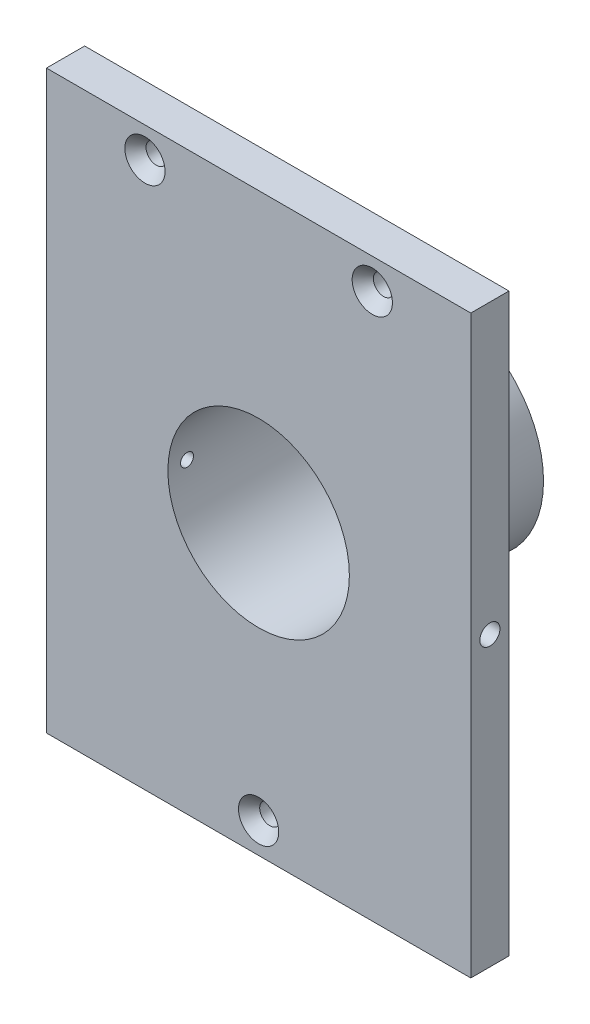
ISO-10303-21;
HEADER;
FILE_DESCRIPTION(('STEP AP214'),'2;1');
FILE_NAME('part.step','',(''),(''),'','','');
FILE_SCHEMA(('AUTOMOTIVE_DESIGN { 1 0 10303 214 1 1 1 1 }'));
ENDSEC;
DATA;
#1=APPLICATION_CONTEXT('core data for automotive mechanical design processes');
#2=APPLICATION_PROTOCOL_DEFINITION('international standard','automotive_design',2000,#1);
#3=PRODUCT_CONTEXT('',#1,'mechanical');
#4=PRODUCT('Part','Part','',(#3));
#5=PRODUCT_RELATED_PRODUCT_CATEGORY('part','',(#4));
#6=PRODUCT_DEFINITION_FORMATION('','',#4);
#7=PRODUCT_DEFINITION_CONTEXT('part definition',#1,'design');
#8=PRODUCT_DEFINITION('design','',#6,#7);
#9=PRODUCT_DEFINITION_SHAPE('','',#8);
#10=(LENGTH_UNIT() NAMED_UNIT(*) SI_UNIT(.MILLI.,.METRE.));
#11=(NAMED_UNIT(*) PLANE_ANGLE_UNIT() SI_UNIT($,.RADIAN.));
#12=(NAMED_UNIT(*) SI_UNIT($,.STERADIAN.) SOLID_ANGLE_UNIT());
#13=UNCERTAINTY_MEASURE_WITH_UNIT(LENGTH_MEASURE(1.E-05),#10,'distance_accuracy_value','');
#14=(GEOMETRIC_REPRESENTATION_CONTEXT(3) GLOBAL_UNCERTAINTY_ASSIGNED_CONTEXT((#13)) GLOBAL_UNIT_ASSIGNED_CONTEXT((#10,
#11,#12)) REPRESENTATION_CONTEXT('',''));
#15=CARTESIAN_POINT('',(0.,0.,0.));
#16=DIRECTION('',(0.,0.,1.));
#17=DIRECTION('',(1.,0.,0.));
#18=AXIS2_PLACEMENT_3D('',#15,#16,#17);
#19=CARTESIAN_POINT('',(-44.45,60.325,8.001));
#20=DIRECTION('',(1.,0.,0.));
#21=DIRECTION('',(0.,1.,0.));
#22=AXIS2_PLACEMENT_3D('',#19,#20,#21);
#23=PLANE('',#22);
#24=DIRECTION('',(0.,-1.,0.));
#25=VECTOR('',#24,1.);
#26=CARTESIAN_POINT('',(-44.45,60.325,0.));
#27=LINE('',#26,#25);
#28=CARTESIAN_POINT('',(-44.45,60.325,0.));
#29=VERTEX_POINT('',#28);
#30=CARTESIAN_POINT('',(-44.45,-60.325,0.));
#31=VERTEX_POINT('',#30);
#32=EDGE_CURVE('E71',#29,#31,#27,.T.);
#33=ORIENTED_EDGE('',*,*,#32,.T.);
#34=DIRECTION('',(0.,0.,-1.));
#35=VECTOR('',#34,1.);
#36=CARTESIAN_POINT('',(-44.45,-60.325,8.001));
#37=LINE('',#36,#35);
#38=CARTESIAN_POINT('',(-44.45,-60.325,8.001));
#39=VERTEX_POINT('',#38);
#40=EDGE_CURVE('E96',#39,#31,#37,.T.);
#41=ORIENTED_EDGE('',*,*,#40,.F.);
#42=DIRECTION('',(0.,-1.,0.));
#43=VECTOR('',#42,1.);
#44=CARTESIAN_POINT('',(-44.45,60.325,8.001));
#45=LINE('',#44,#43);
#46=CARTESIAN_POINT('',(-44.45,60.325,8.001));
#47=VERTEX_POINT('',#46);
#48=EDGE_CURVE('E88',#47,#39,#45,.T.);
#49=ORIENTED_EDGE('',*,*,#48,.F.);
#50=DIRECTION('',(0.,0.,-1.));
#51=VECTOR('',#50,1.);
#52=CARTESIAN_POINT('',(-44.45,60.325,8.001));
#53=LINE('',#52,#51);
#54=EDGE_CURVE('E93',#47,#29,#53,.T.);
#55=ORIENTED_EDGE('',*,*,#54,.T.);
#56=EDGE_LOOP('',(#33,#41,#49,#55));
#57=FACE_BOUND('',#56,.T.);
#58=CARTESIAN_POINT('',(-44.45,0.,4.0005));
#59=DIRECTION('',(1.,0.,0.));
#60=DIRECTION('',(0.,1.,0.));
#61=AXIS2_PLACEMENT_3D('',#58,#59,#60);
#62=CIRCLE('',#61,2.1082);
#63=CARTESIAN_POINT('',(-44.45,-2.1082,4.0005));
#64=VERTEX_POINT('',#63);
#65=EDGE_CURVE('E329',#64,#64,#62,.T.);
#66=ORIENTED_EDGE('',*,*,#65,.T.);
#67=EDGE_LOOP('',(#66));
#68=FACE_BOUND('',#67,.T.);
#69=ADVANCED_FACE('F35',(#57,#68),#23,.F.);
#70=CARTESIAN_POINT('',(0.,0.,0.));
#71=DIRECTION('',(0.,0.,1.));
#72=DIRECTION('',(1.,0.,0.));
#73=AXIS2_PLACEMENT_3D('',#70,#71,#72);
#74=PLANE('',#73);
#75=CARTESIAN_POINT('',(-23.8125,53.975,0.));
#76=DIRECTION('',(0.,0.,1.));
#77=DIRECTION('',(1.,0.,0.));
#78=AXIS2_PLACEMENT_3D('',#75,#76,#77);
#79=CIRCLE('',#78,2.15265);
#80=CARTESIAN_POINT('',(-21.65985,53.975,0.));
#81=VERTEX_POINT('',#80);
#82=EDGE_CURVE('E39',#81,#81,#79,.T.);
#83=ORIENTED_EDGE('',*,*,#82,.T.);
#84=EDGE_LOOP('',(#83));
#85=FACE_BOUND('',#84,.T.);
#86=CARTESIAN_POINT('',(23.8125,53.975,0.));
#87=DIRECTION('',(0.,0.,1.));
#88=DIRECTION('',(1.,0.,0.));
#89=AXIS2_PLACEMENT_3D('',#86,#87,#88);
#90=CIRCLE('',#89,2.15265);
#91=CARTESIAN_POINT('',(25.96515,53.975,0.));
#92=VERTEX_POINT('',#91);
#93=EDGE_CURVE('E118',#92,#92,#90,.T.);
#94=ORIENTED_EDGE('',*,*,#93,.T.);
#95=EDGE_LOOP('',(#94));
#96=FACE_BOUND('',#95,.T.);
#97=CARTESIAN_POINT('',(0.,-53.975,0.));
#98=DIRECTION('',(0.,0.,1.));
#99=DIRECTION('',(1.,0.,0.));
#100=AXIS2_PLACEMENT_3D('',#97,#98,#99);
#101=CIRCLE('',#100,2.15265);
#102=CARTESIAN_POINT('',(2.15265,-53.975,0.));
#103=VERTEX_POINT('',#102);
#104=EDGE_CURVE('E114',#103,#103,#101,.T.);
#105=ORIENTED_EDGE('',*,*,#104,.T.);
#106=EDGE_LOOP('',(#105));
#107=FACE_BOUND('',#106,.T.);
#108=DIRECTION('',(0.,1.,0.));
#109=VECTOR('',#108,1.);
#110=CARTESIAN_POINT('',(44.45,60.325,0.));
#111=LINE('',#110,#109);
#112=CARTESIAN_POINT('',(44.45,-60.325,0.));
#113=VERTEX_POINT('',#112);
#114=CARTESIAN_POINT('',(44.45,60.325,0.));
#115=VERTEX_POINT('',#114);
#116=EDGE_CURVE('E104',#113,#115,#111,.T.);
#117=ORIENTED_EDGE('',*,*,#116,.F.);
#118=DIRECTION('',(1.,0.,0.));
#119=VECTOR('',#118,1.);
#120=CARTESIAN_POINT('',(-44.45,-60.325,0.));
#121=LINE('',#120,#119);
#122=EDGE_CURVE('E77',#31,#113,#121,.T.);
#123=ORIENTED_EDGE('',*,*,#122,.F.);
#124=ORIENTED_EDGE('',*,*,#32,.F.);
#125=DIRECTION('',(-1.,0.,0.));
#126=VECTOR('',#125,1.);
#127=CARTESIAN_POINT('',(-44.45,60.325,0.));
#128=LINE('',#127,#126);
#129=EDGE_CURVE('E95',#115,#29,#128,.T.);
#130=ORIENTED_EDGE('',*,*,#129,.F.);
#131=EDGE_LOOP('',(#117,#123,#124,#130));
#132=FACE_BOUND('',#131,.T.);
#133=CARTESIAN_POINT('',(0.,0.,0.));
#134=DIRECTION('',(0.,0.,1.));
#135=DIRECTION('',(1.,0.,0.));
#136=AXIS2_PLACEMENT_3D('',#133,#134,#135);
#137=CIRCLE('',#136,22.225);
#138=CARTESIAN_POINT('',(22.225,0.,0.));
#139=VERTEX_POINT('',#138);
#140=EDGE_CURVE('E11',#139,#139,#137,.F.);
#141=ORIENTED_EDGE('',*,*,#140,.F.);
#142=EDGE_LOOP('',(#141));
#143=FACE_BOUND('',#142,.T.);
#144=ADVANCED_FACE('F153',(#85,#96,#107,#132,#143),#74,.F.);
#145=CARTESIAN_POINT('',(44.45,60.325,8.001));
#146=DIRECTION('',(-1.,0.,0.));
#147=DIRECTION('',(0.,-1.,0.));
#148=AXIS2_PLACEMENT_3D('',#145,#146,#147);
#149=PLANE('',#148);
#150=CARTESIAN_POINT('',(44.45,0.,4.0005));
#151=DIRECTION('',(1.,0.,0.));
#152=DIRECTION('',(0.,1.,0.));
#153=AXIS2_PLACEMENT_3D('',#150,#151,#152);
#154=CIRCLE('',#153,2.1082);
#155=CARTESIAN_POINT('',(44.45,2.1082,4.0005));
#156=VERTEX_POINT('',#155);
#157=EDGE_CURVE('E347',#156,#156,#154,.T.);
#158=ORIENTED_EDGE('',*,*,#157,.F.);
#159=EDGE_LOOP('',(#158));
#160=FACE_BOUND('',#159,.T.);
#161=ORIENTED_EDGE('',*,*,#116,.T.);
#162=DIRECTION('',(0.,0.,-1.));
#163=VECTOR('',#162,1.);
#164=CARTESIAN_POINT('',(44.45,60.325,8.001));
#165=LINE('',#164,#163);
#166=CARTESIAN_POINT('',(44.45,60.325,8.001));
#167=VERTEX_POINT('',#166);
#168=EDGE_CURVE('E45',#167,#115,#165,.T.);
#169=ORIENTED_EDGE('',*,*,#168,.F.);
#170=DIRECTION('',(0.,1.,0.));
#171=VECTOR('',#170,1.);
#172=CARTESIAN_POINT('',(44.45,60.325,8.001));
#173=LINE('',#172,#171);
#174=CARTESIAN_POINT('',(44.45,-60.325,8.001));
#175=VERTEX_POINT('',#174);
#176=EDGE_CURVE('E90',#175,#167,#173,.T.);
#177=ORIENTED_EDGE('',*,*,#176,.F.);
#178=DIRECTION('',(0.,0.,-1.));
#179=VECTOR('',#178,1.);
#180=CARTESIAN_POINT('',(44.45,-60.325,8.001));
#181=LINE('',#180,#179);
#182=EDGE_CURVE('E100',#175,#113,#181,.T.);
#183=ORIENTED_EDGE('',*,*,#182,.T.);
#184=EDGE_LOOP('',(#161,#169,#177,#183));
#185=FACE_BOUND('',#184,.T.);
#186=ADVANCED_FACE('F37',(#160,#185),#149,.F.);
#187=CARTESIAN_POINT('',(-44.45,60.325,8.001));
#188=DIRECTION('',(0.,-1.,0.));
#189=DIRECTION('',(0.,0.,-1.));
#190=AXIS2_PLACEMENT_3D('',#187,#188,#189);
#191=PLANE('',#190);
#192=ORIENTED_EDGE('',*,*,#129,.T.);
#193=ORIENTED_EDGE('',*,*,#54,.F.);
#194=DIRECTION('',(-1.,0.,0.));
#195=VECTOR('',#194,1.);
#196=CARTESIAN_POINT('',(-44.45,60.325,8.001));
#197=LINE('',#196,#195);
#198=EDGE_CURVE('E85',#167,#47,#197,.T.);
#199=ORIENTED_EDGE('',*,*,#198,.F.);
#200=ORIENTED_EDGE('',*,*,#168,.T.);
#201=EDGE_LOOP('',(#192,#193,#199,#200));
#202=FACE_BOUND('',#201,.T.);
#203=ADVANCED_FACE('F94',(#202),#191,.F.);
#204=CARTESIAN_POINT('',(-44.45,-60.325,8.001));
#205=DIRECTION('',(0.,1.,0.));
#206=DIRECTION('',(0.,0.,1.));
#207=AXIS2_PLACEMENT_3D('',#204,#205,#206);
#208=PLANE('',#207);
#209=ORIENTED_EDGE('',*,*,#122,.T.);
#210=ORIENTED_EDGE('',*,*,#182,.F.);
#211=DIRECTION('',(1.,0.,0.));
#212=VECTOR('',#211,1.);
#213=CARTESIAN_POINT('',(-44.45,-60.325,8.001));
#214=LINE('',#213,#212);
#215=EDGE_CURVE('E54',#39,#175,#214,.T.);
#216=ORIENTED_EDGE('',*,*,#215,.F.);
#217=ORIENTED_EDGE('',*,*,#40,.T.);
#218=EDGE_LOOP('',(#209,#210,#216,#217));
#219=FACE_BOUND('',#218,.T.);
#220=ADVANCED_FACE('F168',(#219),#208,.F.);
#221=CARTESIAN_POINT('',(0.,0.,8.001));
#222=DIRECTION('',(0.,0.,1.));
#223=DIRECTION('',(1.,0.,0.));
#224=AXIS2_PLACEMENT_3D('',#221,#222,#223);
#225=PLANE('',#224);
#226=CARTESIAN_POINT('',(-23.8125,53.975,8.001));
#227=DIRECTION('',(0.,0.,1.));
#228=DIRECTION('',(1.,0.,0.));
#229=AXIS2_PLACEMENT_3D('',#226,#227,#228);
#230=CIRCLE('',#229,4.2164);
#231=CARTESIAN_POINT('',(-19.5961,53.975,8.001));
#232=VERTEX_POINT('',#231);
#233=EDGE_CURVE('E353',#232,#232,#230,.T.);
#234=ORIENTED_EDGE('',*,*,#233,.F.);
#235=EDGE_LOOP('',(#234));
#236=FACE_BOUND('',#235,.T.);
#237=CARTESIAN_POINT('',(23.8125,53.975,8.001));
#238=DIRECTION('',(0.,0.,1.));
#239=DIRECTION('',(1.,0.,0.));
#240=AXIS2_PLACEMENT_3D('',#237,#238,#239);
#241=CIRCLE('',#240,4.2164);
#242=CARTESIAN_POINT('',(28.0289,53.975,8.001));
#243=VERTEX_POINT('',#242);
#244=EDGE_CURVE('E127',#243,#243,#241,.T.);
#245=ORIENTED_EDGE('',*,*,#244,.F.);
#246=EDGE_LOOP('',(#245));
#247=FACE_BOUND('',#246,.T.);
#248=CARTESIAN_POINT('',(0.,-53.975,8.001));
#249=DIRECTION('',(0.,0.,1.));
#250=DIRECTION('',(1.,0.,0.));
#251=AXIS2_PLACEMENT_3D('',#248,#249,#250);
#252=CIRCLE('',#251,4.2164);
#253=CARTESIAN_POINT('',(4.21640000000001,-53.975,8.001));
#254=VERTEX_POINT('',#253);
#255=EDGE_CURVE('E120',#254,#254,#252,.T.);
#256=ORIENTED_EDGE('',*,*,#255,.F.);
#257=EDGE_LOOP('',(#256));
#258=FACE_BOUND('',#257,.T.);
#259=CARTESIAN_POINT('',(0.,0.,8.001));
#260=DIRECTION('',(0.,0.,1.));
#261=DIRECTION('',(1.,0.,0.));
#262=AXIS2_PLACEMENT_3D('',#259,#260,#261);
#263=CIRCLE('',#262,19.0119);
#264=CARTESIAN_POINT('',(19.0119,0.,8.001));
#265=VERTEX_POINT('',#264);
#266=EDGE_CURVE('E116',#265,#265,#263,.T.);
#267=ORIENTED_EDGE('',*,*,#266,.F.);
#268=EDGE_LOOP('',(#267));
#269=FACE_BOUND('',#268,.T.);
#270=ORIENTED_EDGE('',*,*,#176,.T.);
#271=ORIENTED_EDGE('',*,*,#198,.T.);
#272=ORIENTED_EDGE('',*,*,#48,.T.);
#273=ORIENTED_EDGE('',*,*,#215,.T.);
#274=EDGE_LOOP('',(#270,#271,#272,#273));
#275=FACE_BOUND('',#274,.T.);
#276=ADVANCED_FACE('F86',(#236,#247,#258,#269,#275),#225,.T.);
#277=CARTESIAN_POINT('',(0.,0.,-29.464));
#278=DIRECTION('',(0.,0.,1.));
#279=DIRECTION('',(1.,0.,0.));
#280=AXIS2_PLACEMENT_3D('',#277,#278,#279);
#281=CYLINDRICAL_SURFACE('',#280,22.225);
#282=CARTESIAN_POINT('',(0.,0.,-29.464));
#283=DIRECTION('',(0.,0.,-1.));
#284=DIRECTION('',(-1.,0.,0.));
#285=AXIS2_PLACEMENT_3D('',#282,#283,#284);
#286=CIRCLE('',#285,22.225);
#287=CARTESIAN_POINT('',(-22.225,0.,-29.464));
#288=VERTEX_POINT('',#287);
#289=EDGE_CURVE('E107',#288,#288,#286,.T.);
#290=ORIENTED_EDGE('',*,*,#289,.F.);
#291=EDGE_LOOP('',(#290));
#292=FACE_BOUND('',#291,.T.);
#293=ORIENTED_EDGE('',*,*,#140,.T.);
#294=EDGE_LOOP('',(#293));
#295=FACE_BOUND('',#294,.T.);
#296=ADVANCED_FACE('F147',(#292,#295),#281,.T.);
#297=CARTESIAN_POINT('',(0.,0.,-29.464));
#298=DIRECTION('',(0.,0.,-1.));
#299=DIRECTION('',(-1.,0.,0.));
#300=AXIS2_PLACEMENT_3D('',#297,#298,#299);
#301=PLANE('',#300);
#302=CARTESIAN_POINT('',(0.,0.,-29.464));
#303=DIRECTION('',(0.,0.,1.));
#304=DIRECTION('',(1.,0.,0.));
#305=AXIS2_PLACEMENT_3D('',#302,#303,#304);
#306=CIRCLE('',#305,19.0119);
#307=CARTESIAN_POINT('',(19.0119,0.,-29.464));
#308=VERTEX_POINT('',#307);
#309=EDGE_CURVE('E137',#308,#308,#306,.T.);
#310=ORIENTED_EDGE('',*,*,#309,.T.);
#311=EDGE_LOOP('',(#310));
#312=FACE_BOUND('',#311,.T.);
#313=ORIENTED_EDGE('',*,*,#289,.T.);
#314=EDGE_LOOP('',(#313));
#315=FACE_BOUND('',#314,.T.);
#316=ADVANCED_FACE('F145',(#312,#315),#301,.T.);
#317=CARTESIAN_POINT('',(0.,0.,-29.464));
#318=DIRECTION('',(0.,0.,1.));
#319=DIRECTION('',(1.,0.,0.));
#320=AXIS2_PLACEMENT_3D('',#317,#318,#319);
#321=CYLINDRICAL_SURFACE('',#320,19.0119);
#322=CARTESIAN_POINT('',(-19.0119,0.,5.35304999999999));
#323=CARTESIAN_POINT('',(-19.0118993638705,-0.0758703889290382,5.35304667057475));
#324=CARTESIAN_POINT('',(-19.0114409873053,-0.15179334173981,5.34664469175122));
#325=CARTESIAN_POINT('',(-19.0096565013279,-0.301541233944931,5.32119872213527));
#326=CARTESIAN_POINT('',(-19.0083293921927,-0.375363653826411,5.30214016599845));
#327=CARTESIAN_POINT('',(-19.0049575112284,-0.518719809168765,5.2519326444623));
#328=CARTESIAN_POINT('',(-19.0029131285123,-0.588255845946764,5.2207902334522));
#329=CARTESIAN_POINT('',(-18.9983363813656,-0.721095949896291,5.14731007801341));
#330=CARTESIAN_POINT('',(-18.9958041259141,-0.784401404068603,5.10497483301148));
#331=CARTESIAN_POINT('',(-18.9905307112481,-0.903121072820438,5.01022334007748));
#332=CARTESIAN_POINT('',(-18.9877892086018,-0.958521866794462,4.95779029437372));
#333=CARTESIAN_POINT('',(-18.9824091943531,-1.05974463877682,4.84436664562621));
#334=CARTESIAN_POINT('',(-18.9797706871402,-1.10556620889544,4.78337567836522));
#335=CARTESIAN_POINT('',(-18.9748914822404,-1.18637315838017,4.65448894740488));
#336=CARTESIAN_POINT('',(-18.9726512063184,-1.22134707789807,4.58658598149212));
#337=CARTESIAN_POINT('',(-18.9688256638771,-1.27939268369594,4.44585313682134));
#338=CARTESIAN_POINT('',(-18.9672403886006,-1.30246452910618,4.37302332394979));
#339=CARTESIAN_POINT('',(-18.9649069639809,-1.3360129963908,4.22463602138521));
#340=CARTESIAN_POINT('',(-18.9641573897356,-1.34651105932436,4.14908340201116));
#341=CARTESIAN_POINT('',(-18.963575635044,-1.35468016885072,3.99728495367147));
#342=CARTESIAN_POINT('',(-18.9637434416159,-1.35235139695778,3.92103913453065));
#343=CARTESIAN_POINT('',(-18.9649762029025,-1.3349507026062,3.77016503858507));
#344=CARTESIAN_POINT('',(-18.9660395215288,-1.31990201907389,3.69553406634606));
#345=CARTESIAN_POINT('',(-18.9689409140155,-1.27752474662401,3.54986007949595));
#346=CARTESIAN_POINT('',(-18.970778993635,-1.25019606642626,3.47881709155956));
#347=CARTESIAN_POINT('',(-18.9750246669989,-1.18400831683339,3.34226128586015));
#348=CARTESIAN_POINT('',(-18.9774327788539,-1.14513874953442,3.27675357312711));
#349=CARTESIAN_POINT('',(-18.9825466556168,-1.05698017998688,3.15318365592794));
#350=CARTESIAN_POINT('',(-18.9852524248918,-1.0076910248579,3.09512156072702));
#351=CARTESIAN_POINT('',(-18.9906639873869,-0.899961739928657,2.98795587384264));
#352=CARTESIAN_POINT('',(-18.993369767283,-0.84150150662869,2.93887248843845));
#353=CARTESIAN_POINT('',(-18.9984706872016,-0.717159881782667,2.85121351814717));
#354=CARTESIAN_POINT('',(-19.0008658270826,-0.651278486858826,2.81263793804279));
#355=CARTESIAN_POINT('',(-19.0050758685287,-0.51395207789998,2.74709113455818));
#356=CARTESIAN_POINT('',(-19.0068907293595,-0.442506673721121,2.72012072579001));
#357=CARTESIAN_POINT('',(-19.0097352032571,-0.296086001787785,2.6785635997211));
#358=CARTESIAN_POINT('',(-19.0107648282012,-0.221110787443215,2.66397669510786));
#359=CARTESIAN_POINT('',(-19.0119212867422,-0.0699340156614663,2.64762579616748));
#360=CARTESIAN_POINT('',(-19.0120500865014,0.00626450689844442,2.6458338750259));
#361=CARTESIAN_POINT('',(-19.0113956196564,0.157878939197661,2.65505076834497));
#362=CARTESIAN_POINT('',(-19.0106123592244,0.233294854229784,2.66605949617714));
#363=CARTESIAN_POINT('',(-19.0082231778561,0.381124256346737,2.70054205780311));
#364=CARTESIAN_POINT('',(-19.0066181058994,0.453540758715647,2.72400302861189));
#365=CARTESIAN_POINT('',(-19.0027657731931,0.593408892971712,2.78271101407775));
#366=CARTESIAN_POINT('',(-19.0005185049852,0.660860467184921,2.81795816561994));
#367=CARTESIAN_POINT('',(-18.9956291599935,0.789011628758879,2.89930872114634));
#368=CARTESIAN_POINT('',(-18.9929864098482,0.849699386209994,2.9454307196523));
#369=CARTESIAN_POINT('',(-18.987605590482,0.962480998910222,3.04719474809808));
#370=CARTESIAN_POINT('',(-18.9848675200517,1.01457474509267,3.10283689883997));
#371=CARTESIAN_POINT('',(-18.9795989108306,1.10878464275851,3.22218251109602));
#372=CARTESIAN_POINT('',(-18.9770687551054,1.1508826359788,3.28590032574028));
#373=CARTESIAN_POINT('',(-18.9725074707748,1.22378170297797,3.41951668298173));
#374=CARTESIAN_POINT('',(-18.9704763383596,1.2545828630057,3.48941517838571));
#375=CARTESIAN_POINT('',(-18.9671449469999,1.30398268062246,3.63334318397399));
#376=CARTESIAN_POINT('',(-18.9658440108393,1.3225926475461,3.70736879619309));
#377=CARTESIAN_POINT('',(-18.9641178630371,1.34711870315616,3.85750356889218));
#378=CARTESIAN_POINT('',(-18.9636926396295,1.35303496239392,3.9336127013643));
#379=CARTESIAN_POINT('',(-18.96376616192,1.35200390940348,4.08557355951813));
#380=CARTESIAN_POINT('',(-18.9642628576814,1.34508513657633,4.16142548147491));
#381=CARTESIAN_POINT('',(-18.9661199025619,1.31863971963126,4.31088747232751));
#382=CARTESIAN_POINT('',(-18.9674802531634,1.29911305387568,4.38449753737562));
#383=CARTESIAN_POINT('',(-18.9709108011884,1.24801290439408,4.52738959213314));
#384=CARTESIAN_POINT('',(-18.9729809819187,1.21643970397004,4.59667168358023));
#385=CARTESIAN_POINT('',(-18.9775979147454,1.14214628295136,4.72895586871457));
#386=CARTESIAN_POINT('',(-18.9801446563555,1.09942630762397,4.79195810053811));
#387=CARTESIAN_POINT('',(-18.9854344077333,1.00394545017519,4.91003963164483));
#388=CARTESIAN_POINT('',(-18.9881778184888,0.951163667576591,4.96510201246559));
#389=CARTESIAN_POINT('',(-18.9935482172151,0.837090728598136,5.06560541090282));
#390=CARTESIAN_POINT('',(-18.9961751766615,0.775797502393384,5.11104408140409));
#391=CARTESIAN_POINT('',(-19.0010201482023,0.646353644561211,5.19105394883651));
#392=CARTESIAN_POINT('',(-19.0032375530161,0.578193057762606,5.22560906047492));
#393=CARTESIAN_POINT('',(-19.0070058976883,0.437070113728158,5.28274147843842));
#394=CARTESIAN_POINT('',(-19.0085576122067,0.364113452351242,5.30533271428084));
#395=CARTESIAN_POINT('',(-19.0104162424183,0.242263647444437,5.33206920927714));
#396=CARTESIAN_POINT('',(-19.0109701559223,0.194156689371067,5.33992672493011));
#397=CARTESIAN_POINT('',(-19.0117122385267,0.0973737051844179,5.35041818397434));
#398=CARTESIAN_POINT('',(-19.011900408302,0.0486976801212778,5.35305213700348));
#399=CARTESIAN_POINT('',(-19.0119,0.,5.35304999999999));
#400=B_SPLINE_CURVE_WITH_KNOTS('',3,(#322,#323,#324,#325,#326,#327,#328,#329,#330,#331,#332,
#333,#334,#335,#336,#337,#338,#339,#340,#341,#342,#343,#344,#345,#346,#347,#348,#349,#350,#351,
#352,#353,#354,#355,#356,#357,#358,#359,#360,#361,#362,#363,#364,#365,#366,#367,#368,#369,#370,
#371,#372,#373,#374,#375,#376,#377,#378,#379,#380,#381,#382,#383,#384,#385,#386,#387,#388,#389,
#390,#391,#392,#393,#394,#395,#396,#397,#398,#399),.UNSPECIFIED.,.T.,.F.,(4,2,2,2,2,2,2,2,2,2,2,
2,2,2,2,2,2,2,2,2,2,2,2,2,2,2,2,2,2,2,2,2,2,2,2,2,2,2,4),(0.,0.227433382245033,
0.455128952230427,0.682701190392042,0.910222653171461,1.1381259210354,1.3660388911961,
1.59419182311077,1.82234170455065,2.05010198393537,2.27785904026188,2.50520088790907,
2.73254442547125,2.96009539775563,3.18764970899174,3.41570998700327,3.64377036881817,
3.87184675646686,4.09991969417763,4.32749467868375,4.5550681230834,4.78240694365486,
5.00974840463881,5.23748144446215,5.46521737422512,5.69336389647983,5.92150867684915,
6.14944151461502,6.37737128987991,6.60479485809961,6.83221881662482,7.05963742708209,
7.28705103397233,7.51494227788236,7.74288903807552,7.97117112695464,8.19918683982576,
8.34516603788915,8.49114496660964),.UNSPECIFIED.);
#401=CARTESIAN_POINT('',(-19.0119,0.,5.35304999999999));
#402=VERTEX_POINT('',#401);
#403=EDGE_CURVE('E325',#402,#402,#400,.T.);
#404=ORIENTED_EDGE('',*,*,#403,.F.);
#405=EDGE_LOOP('',(#404));
#406=FACE_BOUND('',#405,.T.);
#407=CARTESIAN_POINT('',(19.0119,0.,2.64795000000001));
#408=CARTESIAN_POINT('',(19.0118993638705,0.0758703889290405,2.64795332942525));
#409=CARTESIAN_POINT('',(19.0114409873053,0.151793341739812,2.65435530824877));
#410=CARTESIAN_POINT('',(19.0096565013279,0.301541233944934,2.67980127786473));
#411=CARTESIAN_POINT('',(19.0083293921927,0.375363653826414,2.69885983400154));
#412=CARTESIAN_POINT('',(19.0049575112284,0.518719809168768,2.74906735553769));
#413=CARTESIAN_POINT('',(19.0029131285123,0.588255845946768,2.7802097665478));
#414=CARTESIAN_POINT('',(18.9983363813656,0.721095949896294,2.85368992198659));
#415=CARTESIAN_POINT('',(18.9958041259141,0.784401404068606,2.89602516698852));
#416=CARTESIAN_POINT('',(18.9905307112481,0.903121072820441,2.99077665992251));
#417=CARTESIAN_POINT('',(18.9877892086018,0.958521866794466,3.04320970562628));
#418=CARTESIAN_POINT('',(18.9824091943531,1.05974463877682,3.15663335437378));
#419=CARTESIAN_POINT('',(18.9797706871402,1.10556620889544,3.21762432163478));
#420=CARTESIAN_POINT('',(18.9748914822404,1.18637315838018,3.34651105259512));
#421=CARTESIAN_POINT('',(18.9726512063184,1.22134707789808,3.41441401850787));
#422=CARTESIAN_POINT('',(18.9688256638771,1.27939268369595,3.55514686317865));
#423=CARTESIAN_POINT('',(18.9672403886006,1.30246452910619,3.62797667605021));
#424=CARTESIAN_POINT('',(18.9649069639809,1.33601299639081,3.77636397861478));
#425=CARTESIAN_POINT('',(18.9641573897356,1.34651105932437,3.85191659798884));
#426=CARTESIAN_POINT('',(18.963575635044,1.35468016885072,4.00371504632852));
#427=CARTESIAN_POINT('',(18.9637434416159,1.35235139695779,4.07996086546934));
#428=CARTESIAN_POINT('',(18.9649762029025,1.3349507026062,4.23083496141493));
#429=CARTESIAN_POINT('',(18.9660395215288,1.31990201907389,4.30546593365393));
#430=CARTESIAN_POINT('',(18.9689409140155,1.27752474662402,4.45113992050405));
#431=CARTESIAN_POINT('',(18.970778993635,1.25019606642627,4.52218290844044));
#432=CARTESIAN_POINT('',(18.9750246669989,1.1840083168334,4.65873871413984));
#433=CARTESIAN_POINT('',(18.9774327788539,1.14513874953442,4.72424642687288));
#434=CARTESIAN_POINT('',(18.9825466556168,1.05698017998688,4.84781634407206));
#435=CARTESIAN_POINT('',(18.9852524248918,1.0076910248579,4.90587843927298));
#436=CARTESIAN_POINT('',(18.9906639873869,0.899961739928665,5.01304412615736));
#437=CARTESIAN_POINT('',(18.993369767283,0.841501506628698,5.06212751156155));
#438=CARTESIAN_POINT('',(18.9984706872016,0.717159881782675,5.14978648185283));
#439=CARTESIAN_POINT('',(19.0008658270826,0.651278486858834,5.18836206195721));
#440=CARTESIAN_POINT('',(19.0050758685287,0.513952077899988,5.25390886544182));
#441=CARTESIAN_POINT('',(19.0068907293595,0.442506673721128,5.28087927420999));
#442=CARTESIAN_POINT('',(19.0097352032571,0.296086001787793,5.3224364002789));
#443=CARTESIAN_POINT('',(19.0107648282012,0.221110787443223,5.33702330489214));
#444=CARTESIAN_POINT('',(19.0119212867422,0.0699340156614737,5.35337420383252));
#445=CARTESIAN_POINT('',(19.0120500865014,-0.00626450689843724,5.3551661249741));
#446=CARTESIAN_POINT('',(19.0113956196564,-0.157878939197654,5.34594923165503));
#447=CARTESIAN_POINT('',(19.0106123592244,-0.233294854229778,5.33494050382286));
#448=CARTESIAN_POINT('',(19.0082231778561,-0.38112425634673,5.30045794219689));
#449=CARTESIAN_POINT('',(19.0066181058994,-0.45354075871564,5.27699697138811));
#450=CARTESIAN_POINT('',(19.0027657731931,-0.593408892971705,5.21828898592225));
#451=CARTESIAN_POINT('',(19.0005185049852,-0.660860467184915,5.18304183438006));
#452=CARTESIAN_POINT('',(18.9956291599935,-0.789011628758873,5.10169127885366));
#453=CARTESIAN_POINT('',(18.9929864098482,-0.849699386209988,5.0555692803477));
#454=CARTESIAN_POINT('',(18.987605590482,-0.962480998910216,4.95380525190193));
#455=CARTESIAN_POINT('',(18.9848675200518,-1.01457474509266,4.89816310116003));
#456=CARTESIAN_POINT('',(18.9795989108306,-1.10878464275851,4.77881748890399));
#457=CARTESIAN_POINT('',(18.9770687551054,-1.1508826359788,4.71509967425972));
#458=CARTESIAN_POINT('',(18.9725074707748,-1.22378170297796,4.58148331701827));
#459=CARTESIAN_POINT('',(18.9704763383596,-1.2545828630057,4.51158482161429));
#460=CARTESIAN_POINT('',(18.9671449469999,-1.30398268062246,4.36765681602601));
#461=CARTESIAN_POINT('',(18.9658440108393,-1.3225926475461,4.29363120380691));
#462=CARTESIAN_POINT('',(18.9641178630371,-1.34711870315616,4.14349643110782));
#463=CARTESIAN_POINT('',(18.9636926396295,-1.35303496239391,4.0673872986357));
#464=CARTESIAN_POINT('',(18.96376616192,-1.35200390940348,3.91542644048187));
#465=CARTESIAN_POINT('',(18.9642628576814,-1.34508513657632,3.83957451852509));
#466=CARTESIAN_POINT('',(18.9661199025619,-1.31863971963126,3.69011252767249));
#467=CARTESIAN_POINT('',(18.9674802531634,-1.29911305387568,3.61650246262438));
#468=CARTESIAN_POINT('',(18.9709108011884,-1.24801290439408,3.47361040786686));
#469=CARTESIAN_POINT('',(18.9729809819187,-1.21643970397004,3.40432831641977));
#470=CARTESIAN_POINT('',(18.9775979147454,-1.14214628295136,3.27204413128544));
#471=CARTESIAN_POINT('',(18.9801446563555,-1.09942630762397,3.20904189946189));
#472=CARTESIAN_POINT('',(18.9854344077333,-1.00394545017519,3.09096036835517));
#473=CARTESIAN_POINT('',(18.9881778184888,-0.951163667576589,3.03589798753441));
#474=CARTESIAN_POINT('',(18.9935482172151,-0.837090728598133,2.93539458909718));
#475=CARTESIAN_POINT('',(18.9961751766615,-0.775797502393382,2.88995591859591));
#476=CARTESIAN_POINT('',(19.0010201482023,-0.646353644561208,2.80994605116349));
#477=CARTESIAN_POINT('',(19.0032375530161,-0.578193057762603,2.77539093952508));
#478=CARTESIAN_POINT('',(19.0070058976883,-0.437070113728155,2.71825852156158));
#479=CARTESIAN_POINT('',(19.0085576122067,-0.364113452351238,2.69566728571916));
#480=CARTESIAN_POINT('',(19.0104162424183,-0.242263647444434,2.66893079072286));
#481=CARTESIAN_POINT('',(19.0109701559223,-0.194156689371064,2.66107327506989));
#482=CARTESIAN_POINT('',(19.0117122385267,-0.0973737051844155,2.65058181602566));
#483=CARTESIAN_POINT('',(19.011900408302,-0.0486976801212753,2.64794786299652));
#484=CARTESIAN_POINT('',(19.0119,0.,2.64795000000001));
#485=B_SPLINE_CURVE_WITH_KNOTS('',3,(#407,#408,#409,#410,#411,#412,#413,#414,#415,#416,#417,
#418,#419,#420,#421,#422,#423,#424,#425,#426,#427,#428,#429,#430,#431,#432,#433,#434,#435,#436,
#437,#438,#439,#440,#441,#442,#443,#444,#445,#446,#447,#448,#449,#450,#451,#452,#453,#454,#455,
#456,#457,#458,#459,#460,#461,#462,#463,#464,#465,#466,#467,#468,#469,#470,#471,#472,#473,#474,
#475,#476,#477,#478,#479,#480,#481,#482,#483,#484),.UNSPECIFIED.,.T.,.F.,(4,2,2,2,2,2,2,2,2,2,2,
2,2,2,2,2,2,2,2,2,2,2,2,2,2,2,2,2,2,2,2,2,2,2,2,2,2,2,4),(0.,0.227433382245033,
0.455128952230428,0.682701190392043,0.910222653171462,1.1381259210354,1.3660388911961,
1.59419182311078,1.82234170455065,2.05010198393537,2.27785904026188,2.50520088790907,
2.73254442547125,2.96009539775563,3.18764970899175,3.41570998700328,3.64377036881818,
3.87184675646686,4.09991969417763,4.32749467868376,4.55506812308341,4.78240694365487,
5.00974840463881,5.23748144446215,5.46521737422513,5.69336389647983,5.92150867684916,
6.14944151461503,6.37737128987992,6.60479485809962,6.83221881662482,7.0596374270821,
7.28705103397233,7.51494227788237,7.74288903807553,7.97117112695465,8.19918683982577,
8.34516603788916,8.49114496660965),.UNSPECIFIED.);
#486=CARTESIAN_POINT('',(19.0119,0.,2.64795000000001));
#487=VERTEX_POINT('',#486);
#488=EDGE_CURVE('E341',#487,#487,#485,.T.);
#489=ORIENTED_EDGE('',*,*,#488,.T.);
#490=EDGE_LOOP('',(#489));
#491=FACE_BOUND('',#490,.T.);
#492=ORIENTED_EDGE('',*,*,#309,.F.);
#493=EDGE_LOOP('',(#492));
#494=FACE_BOUND('',#493,.T.);
#495=ORIENTED_EDGE('',*,*,#266,.T.);
#496=EDGE_LOOP('',(#495));
#497=FACE_BOUND('',#496,.T.);
#498=ADVANCED_FACE('F198',(#406,#491,#494,#497),#321,.F.);
#499=CARTESIAN_POINT('',(0.,-53.975,8.001));
#500=DIRECTION('',(0.,0.,1.));
#501=DIRECTION('',(1.,0.,0.));
#502=AXIS2_PLACEMENT_3D('',#499,#500,#501);
#503=CYLINDRICAL_SURFACE('',#502,2.15265);
#504=CARTESIAN_POINT('',(0.,-53.975,5.62692719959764));
#505=DIRECTION('',(0.,0.,1.));
#506=DIRECTION('',(1.,0.,0.));
#507=AXIS2_PLACEMENT_3D('',#504,#505,#506);
#508=CIRCLE('',#507,2.15265);
#509=CARTESIAN_POINT('',(2.15265,-53.975,5.62692719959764));
#510=VERTEX_POINT('',#509);
#511=EDGE_CURVE('E117',#510,#510,#508,.T.);
#512=ORIENTED_EDGE('',*,*,#511,.T.);
#513=EDGE_LOOP('',(#512));
#514=FACE_BOUND('',#513,.T.);
#515=ORIENTED_EDGE('',*,*,#104,.F.);
#516=EDGE_LOOP('',(#515));
#517=FACE_BOUND('',#516,.T.);
#518=ADVANCED_FACE('F207',(#514,#517),#503,.F.);
#519=CARTESIAN_POINT('',(0.,-53.975,8.001));
#520=DIRECTION('',(0.,0.,1.));
#521=DIRECTION('',(1.,0.,0.));
#522=AXIS2_PLACEMENT_3D('',#519,#520,#521);
#523=CONICAL_SURFACE('',#522,4.2164,0.715584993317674);
#524=ORIENTED_EDGE('',*,*,#511,.F.);
#525=EDGE_LOOP('',(#524));
#526=FACE_BOUND('',#525,.T.);
#527=ORIENTED_EDGE('',*,*,#255,.T.);
#528=EDGE_LOOP('',(#527));
#529=FACE_BOUND('',#528,.T.);
#530=ADVANCED_FACE('F217',(#526,#529),#523,.F.);
#531=CARTESIAN_POINT('',(23.8125,53.975,8.001));
#532=DIRECTION('',(0.,0.,1.));
#533=DIRECTION('',(1.,0.,0.));
#534=AXIS2_PLACEMENT_3D('',#531,#532,#533);
#535=CYLINDRICAL_SURFACE('',#534,2.15265);
#536=CARTESIAN_POINT('',(23.8125,53.975,5.62692719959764));
#537=DIRECTION('',(0.,0.,1.));
#538=DIRECTION('',(1.,0.,0.));
#539=AXIS2_PLACEMENT_3D('',#536,#537,#538);
#540=CIRCLE('',#539,2.15265);
#541=CARTESIAN_POINT('',(25.96515,53.975,5.62692719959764));
#542=VERTEX_POINT('',#541);
#543=EDGE_CURVE('E121',#542,#542,#540,.T.);
#544=ORIENTED_EDGE('',*,*,#543,.T.);
#545=EDGE_LOOP('',(#544));
#546=FACE_BOUND('',#545,.T.);
#547=ORIENTED_EDGE('',*,*,#93,.F.);
#548=EDGE_LOOP('',(#547));
#549=FACE_BOUND('',#548,.T.);
#550=ADVANCED_FACE('F224',(#546,#549),#535,.F.);
#551=CARTESIAN_POINT('',(23.8125,53.975,8.001));
#552=DIRECTION('',(0.,0.,1.));
#553=DIRECTION('',(1.,0.,0.));
#554=AXIS2_PLACEMENT_3D('',#551,#552,#553);
#555=CONICAL_SURFACE('',#554,4.2164,0.715584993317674);
#556=ORIENTED_EDGE('',*,*,#543,.F.);
#557=EDGE_LOOP('',(#556));
#558=FACE_BOUND('',#557,.T.);
#559=ORIENTED_EDGE('',*,*,#244,.T.);
#560=EDGE_LOOP('',(#559));
#561=FACE_BOUND('',#560,.T.);
#562=ADVANCED_FACE('F232',(#558,#561),#555,.F.);
#563=CARTESIAN_POINT('',(-23.8125,53.975,8.001));
#564=DIRECTION('',(0.,0.,1.));
#565=DIRECTION('',(1.,0.,0.));
#566=AXIS2_PLACEMENT_3D('',#563,#564,#565);
#567=CYLINDRICAL_SURFACE('',#566,2.15265);
#568=CARTESIAN_POINT('',(-23.8125,53.975,5.62692719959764));
#569=DIRECTION('',(0.,0.,1.));
#570=DIRECTION('',(1.,0.,0.));
#571=AXIS2_PLACEMENT_3D('',#568,#569,#570);
#572=CIRCLE('',#571,2.15265);
#573=CARTESIAN_POINT('',(-21.65985,53.975,5.62692719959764));
#574=VERTEX_POINT('',#573);
#575=EDGE_CURVE('E357',#574,#574,#572,.T.);
#576=ORIENTED_EDGE('',*,*,#575,.T.);
#577=EDGE_LOOP('',(#576));
#578=FACE_BOUND('',#577,.T.);
#579=ORIENTED_EDGE('',*,*,#82,.F.);
#580=EDGE_LOOP('',(#579));
#581=FACE_BOUND('',#580,.T.);
#582=ADVANCED_FACE('F239',(#578,#581),#567,.F.);
#583=CARTESIAN_POINT('',(-23.8125,53.975,8.001));
#584=DIRECTION('',(0.,0.,1.));
#585=DIRECTION('',(1.,0.,0.));
#586=AXIS2_PLACEMENT_3D('',#583,#584,#585);
#587=CONICAL_SURFACE('',#586,4.2164,0.715584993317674);
#588=ORIENTED_EDGE('',*,*,#575,.F.);
#589=EDGE_LOOP('',(#588));
#590=FACE_BOUND('',#589,.T.);
#591=ORIENTED_EDGE('',*,*,#233,.T.);
#592=EDGE_LOOP('',(#591));
#593=FACE_BOUND('',#592,.T.);
#594=ADVANCED_FACE('F247',(#590,#593),#587,.F.);
#595=CARTESIAN_POINT('',(25.4,0.,4.0005));
#596=DIRECTION('',(1.,0.,0.));
#597=DIRECTION('',(0.,1.,0.));
#598=AXIS2_PLACEMENT_3D('',#595,#596,#597);
#599=CYLINDRICAL_SURFACE('',#598,2.1082);
#600=CARTESIAN_POINT('',(25.4,0.,4.0005));
#601=DIRECTION('',(1.,0.,0.));
#602=DIRECTION('',(0.,1.,0.));
#603=AXIS2_PLACEMENT_3D('',#600,#601,#602);
#604=CIRCLE('',#603,2.1082);
#605=CARTESIAN_POINT('',(25.4,2.1082,4.0005));
#606=VERTEX_POINT('',#605);
#607=EDGE_CURVE('E348',#606,#606,#604,.T.);
#608=CARTESIAN_POINT('',(25.4,2.1082,4.0005));
#609=CARTESIAN_POINT('',(25.5984375,2.1082,4.0005));
#610=CARTESIAN_POINT('',(25.796875,2.1082,4.0005));
#611=CARTESIAN_POINT('',(26.19375,2.1082,4.0005));
#612=CARTESIAN_POINT('',(26.3921875,2.1082,4.0005));
#613=CARTESIAN_POINT('',(26.7890625,2.1082,4.0005));
#614=CARTESIAN_POINT('',(26.9875,2.1082,4.0005));
#615=CARTESIAN_POINT('',(27.384375,2.1082,4.0005));
#616=CARTESIAN_POINT('',(27.5828125,2.1082,4.0005));
#617=CARTESIAN_POINT('',(27.9796875,2.1082,4.0005));
#618=CARTESIAN_POINT('',(28.178125,2.1082,4.0005));
#619=CARTESIAN_POINT('',(28.575,2.1082,4.0005));
#620=CARTESIAN_POINT('',(28.7734375,2.1082,4.0005));
#621=CARTESIAN_POINT('',(29.1703125,2.1082,4.0005));
#622=CARTESIAN_POINT('',(29.36875,2.1082,4.0005));
#623=CARTESIAN_POINT('',(29.765625,2.1082,4.0005));
#624=CARTESIAN_POINT('',(29.9640625,2.1082,4.0005));
#625=CARTESIAN_POINT('',(30.3609375,2.1082,4.0005));
#626=CARTESIAN_POINT('',(30.559375,2.1082,4.0005));
#627=CARTESIAN_POINT('',(30.95625,2.1082,4.0005));
#628=CARTESIAN_POINT('',(31.1546875,2.1082,4.0005));
#629=CARTESIAN_POINT('',(31.5515625,2.1082,4.0005));
#630=CARTESIAN_POINT('',(31.75,2.1082,4.0005));
#631=CARTESIAN_POINT('',(32.146875,2.1082,4.0005));
#632=CARTESIAN_POINT('',(32.3453125,2.1082,4.0005));
#633=CARTESIAN_POINT('',(32.7421875,2.1082,4.0005));
#634=CARTESIAN_POINT('',(32.940625,2.1082,4.0005));
#635=CARTESIAN_POINT('',(33.3375,2.1082,4.0005));
#636=CARTESIAN_POINT('',(33.5359375,2.1082,4.0005));
#637=CARTESIAN_POINT('',(33.9328125,2.1082,4.0005));
#638=CARTESIAN_POINT('',(34.13125,2.1082,4.0005));
#639=CARTESIAN_POINT('',(34.528125,2.1082,4.0005));
#640=CARTESIAN_POINT('',(34.7265625,2.1082,4.0005));
#641=CARTESIAN_POINT('',(35.1234375,2.1082,4.0005));
#642=CARTESIAN_POINT('',(35.321875,2.1082,4.0005));
#643=CARTESIAN_POINT('',(35.71875,2.1082,4.0005));
#644=CARTESIAN_POINT('',(35.9171875,2.1082,4.0005));
#645=CARTESIAN_POINT('',(36.3140625,2.1082,4.0005));
#646=CARTESIAN_POINT('',(36.5125,2.1082,4.0005));
#647=CARTESIAN_POINT('',(36.909375,2.1082,4.0005));
#648=CARTESIAN_POINT('',(37.1078125,2.1082,4.0005));
#649=CARTESIAN_POINT('',(37.5046875,2.1082,4.0005));
#650=CARTESIAN_POINT('',(37.703125,2.1082,4.0005));
#651=CARTESIAN_POINT('',(38.1,2.1082,4.0005));
#652=CARTESIAN_POINT('',(38.2984375,2.1082,4.0005));
#653=CARTESIAN_POINT('',(38.6953125,2.1082,4.0005));
#654=CARTESIAN_POINT('',(38.89375,2.1082,4.0005));
#655=CARTESIAN_POINT('',(39.290625,2.1082,4.0005));
#656=CARTESIAN_POINT('',(39.4890625,2.1082,4.0005));
#657=CARTESIAN_POINT('',(39.8859375,2.1082,4.0005));
#658=CARTESIAN_POINT('',(40.084375,2.1082,4.0005));
#659=CARTESIAN_POINT('',(40.48125,2.1082,4.0005));
#660=CARTESIAN_POINT('',(40.6796875,2.1082,4.0005));
#661=CARTESIAN_POINT('',(41.0765625,2.1082,4.0005));
#662=CARTESIAN_POINT('',(41.275,2.1082,4.0005));
#663=CARTESIAN_POINT('',(41.671875,2.1082,4.0005));
#664=CARTESIAN_POINT('',(41.8703125,2.1082,4.0005));
#665=CARTESIAN_POINT('',(42.2671875,2.1082,4.0005));
#666=CARTESIAN_POINT('',(42.465625,2.1082,4.0005));
#667=CARTESIAN_POINT('',(42.8625,2.1082,4.0005));
#668=CARTESIAN_POINT('',(43.0609375,2.1082,4.0005));
#669=CARTESIAN_POINT('',(43.4578125,2.1082,4.0005));
#670=CARTESIAN_POINT('',(43.65625,2.1082,4.0005));
#671=CARTESIAN_POINT('',(44.053125,2.1082,4.0005));
#672=CARTESIAN_POINT('',(44.2515625,2.1082,4.0005));
#673=CARTESIAN_POINT('',(44.45,2.1082,4.0005));
#674=B_SPLINE_CURVE_WITH_KNOTS('',3,(#608,#609,#610,#611,#612,#613,#614,#615,#616,#617,#618,
#619,#620,#621,#622,#623,#624,#625,#626,#627,#628,#629,#630,#631,#632,#633,#634,#635,#636,#637,
#638,#639,#640,#641,#642,#643,#644,#645,#646,#647,#648,#649,#650,#651,#652,#653,#654,#655,#656,
#657,#658,#659,#660,#661,#662,#663,#664,#665,#666,#667,#668,#669,#670,#671,#672,#673),
.UNSPECIFIED.,.F.,.F.,(4,2,2,2,2,2,2,2,2,2,2,2,2,2,2,2,2,2,2,2,2,2,2,2,2,2,2,2,2,2,2,2,4),(0.,
0.5953125,1.190625,1.7859375,2.38125,2.9765625,3.571875,4.1671875,4.7625,5.3578125,5.953125,
6.5484375,7.14375,7.7390625,8.334375,8.92968750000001,9.52500000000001,10.1203125,10.715625,
11.3109375,11.90625,12.5015625,13.096875,13.6921875,14.2875,14.8828125,15.478125,16.0734375,
16.66875,17.2640625,17.859375,18.4546875,19.05),.UNSPECIFIED.);
#675=EDGE_CURVE('BSEAM255',#606,#156,#674,.T.);
#676=ORIENTED_EDGE('',*,*,#607,.F.);
#677=ORIENTED_EDGE('',*,*,#157,.T.);
#678=ORIENTED_EDGE('',*,*,#675,.T.);
#679=ORIENTED_EDGE('',*,*,#675,.F.);
#680=EDGE_LOOP('',(#676,#678,#677,#679));
#681=FACE_BOUND('',#680,.T.);
#682=ADVANCED_FACE('F255',(#681),#599,.F.);
#683=CARTESIAN_POINT('',(25.4,0.,4.0005));
#684=DIRECTION('',(1.,0.,0.));
#685=DIRECTION('',(0.,1.,0.));
#686=AXIS2_PLACEMENT_3D('',#683,#684,#685);
#687=PLANE('',#686);
#688=CARTESIAN_POINT('',(25.4,0.,4.0005));
#689=DIRECTION('',(1.,0.,0.));
#690=DIRECTION('',(0.,0.,-1.));
#691=AXIS2_PLACEMENT_3D('',#688,#689,#690);
#692=CIRCLE('',#691,1.35254999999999);
#693=CARTESIAN_POINT('',(25.4,0.,2.64795000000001));
#694=VERTEX_POINT('',#693);
#695=EDGE_CURVE('E336',#694,#694,#692,.T.);
#696=ORIENTED_EDGE('',*,*,#695,.F.);
#697=EDGE_LOOP('',(#696));
#698=FACE_BOUND('',#697,.T.);
#699=ORIENTED_EDGE('',*,*,#607,.T.);
#700=EDGE_LOOP('',(#699));
#701=FACE_BOUND('',#700,.T.);
#702=ADVANCED_FACE('F270',(#698,#701),#687,.T.);
#703=CARTESIAN_POINT('',(25.4,0.,4.0005));
#704=DIRECTION('',(1.,0.,0.));
#705=DIRECTION('',(0.,0.,-1.));
#706=AXIS2_PLACEMENT_3D('',#703,#704,#705);
#707=CYLINDRICAL_SURFACE('',#706,1.35254999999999);
#708=ORIENTED_EDGE('',*,*,#488,.F.);
#709=EDGE_LOOP('',(#708));
#710=FACE_BOUND('',#709,.T.);
#711=ORIENTED_EDGE('',*,*,#695,.T.);
#712=EDGE_LOOP('',(#711));
#713=FACE_BOUND('',#712,.T.);
#714=ADVANCED_FACE('F278',(#710,#713),#707,.F.);
#715=CARTESIAN_POINT('',(-25.4,0.,4.0005));
#716=DIRECTION('',(-1.,0.,0.));
#717=DIRECTION('',(0.,-1.,0.));
#718=AXIS2_PLACEMENT_3D('',#715,#716,#717);
#719=CYLINDRICAL_SURFACE('',#718,2.1082);
#720=CARTESIAN_POINT('',(-25.4,0.,4.0005));
#721=DIRECTION('',(1.,0.,0.));
#722=DIRECTION('',(0.,1.,0.));
#723=AXIS2_PLACEMENT_3D('',#720,#721,#722);
#724=CIRCLE('',#723,2.1082);
#725=CARTESIAN_POINT('',(-25.4,-2.1082,4.0005));
#726=VERTEX_POINT('',#725);
#727=EDGE_CURVE('E333',#726,#726,#724,.T.);
#728=CARTESIAN_POINT('',(-25.4,-2.1082,4.0005));
#729=CARTESIAN_POINT('',(-25.5984375,-2.1082,4.0005));
#730=CARTESIAN_POINT('',(-25.796875,-2.1082,4.0005));
#731=CARTESIAN_POINT('',(-26.19375,-2.1082,4.0005));
#732=CARTESIAN_POINT('',(-26.3921875,-2.1082,4.0005));
#733=CARTESIAN_POINT('',(-26.7890625,-2.1082,4.0005));
#734=CARTESIAN_POINT('',(-26.9875,-2.1082,4.0005));
#735=CARTESIAN_POINT('',(-27.384375,-2.1082,4.0005));
#736=CARTESIAN_POINT('',(-27.5828125,-2.1082,4.0005));
#737=CARTESIAN_POINT('',(-27.9796875,-2.1082,4.0005));
#738=CARTESIAN_POINT('',(-28.178125,-2.1082,4.0005));
#739=CARTESIAN_POINT('',(-28.575,-2.1082,4.0005));
#740=CARTESIAN_POINT('',(-28.7734375,-2.1082,4.0005));
#741=CARTESIAN_POINT('',(-29.1703125,-2.1082,4.0005));
#742=CARTESIAN_POINT('',(-29.36875,-2.1082,4.0005));
#743=CARTESIAN_POINT('',(-29.765625,-2.1082,4.0005));
#744=CARTESIAN_POINT('',(-29.9640625,-2.1082,4.0005));
#745=CARTESIAN_POINT('',(-30.3609375,-2.1082,4.0005));
#746=CARTESIAN_POINT('',(-30.559375,-2.1082,4.0005));
#747=CARTESIAN_POINT('',(-30.95625,-2.1082,4.0005));
#748=CARTESIAN_POINT('',(-31.1546875,-2.1082,4.0005));
#749=CARTESIAN_POINT('',(-31.5515625,-2.1082,4.0005));
#750=CARTESIAN_POINT('',(-31.75,-2.1082,4.0005));
#751=CARTESIAN_POINT('',(-32.146875,-2.1082,4.0005));
#752=CARTESIAN_POINT('',(-32.3453125,-2.1082,4.0005));
#753=CARTESIAN_POINT('',(-32.7421875,-2.1082,4.0005));
#754=CARTESIAN_POINT('',(-32.940625,-2.1082,4.0005));
#755=CARTESIAN_POINT('',(-33.3375,-2.1082,4.0005));
#756=CARTESIAN_POINT('',(-33.5359375,-2.1082,4.0005));
#757=CARTESIAN_POINT('',(-33.9328125,-2.1082,4.0005));
#758=CARTESIAN_POINT('',(-34.13125,-2.1082,4.0005));
#759=CARTESIAN_POINT('',(-34.528125,-2.1082,4.0005));
#760=CARTESIAN_POINT('',(-34.7265625,-2.1082,4.0005));
#761=CARTESIAN_POINT('',(-35.1234375,-2.1082,4.0005));
#762=CARTESIAN_POINT('',(-35.321875,-2.1082,4.0005));
#763=CARTESIAN_POINT('',(-35.71875,-2.1082,4.0005));
#764=CARTESIAN_POINT('',(-35.9171875,-2.1082,4.0005));
#765=CARTESIAN_POINT('',(-36.3140625,-2.1082,4.0005));
#766=CARTESIAN_POINT('',(-36.5125,-2.1082,4.0005));
#767=CARTESIAN_POINT('',(-36.909375,-2.1082,4.0005));
#768=CARTESIAN_POINT('',(-37.1078125,-2.1082,4.0005));
#769=CARTESIAN_POINT('',(-37.5046875,-2.1082,4.0005));
#770=CARTESIAN_POINT('',(-37.703125,-2.1082,4.0005));
#771=CARTESIAN_POINT('',(-38.1,-2.1082,4.0005));
#772=CARTESIAN_POINT('',(-38.2984375,-2.1082,4.0005));
#773=CARTESIAN_POINT('',(-38.6953125,-2.1082,4.0005));
#774=CARTESIAN_POINT('',(-38.89375,-2.1082,4.0005));
#775=CARTESIAN_POINT('',(-39.290625,-2.1082,4.0005));
#776=CARTESIAN_POINT('',(-39.4890625,-2.1082,4.0005));
#777=CARTESIAN_POINT('',(-39.8859375,-2.1082,4.0005));
#778=CARTESIAN_POINT('',(-40.084375,-2.1082,4.0005));
#779=CARTESIAN_POINT('',(-40.48125,-2.1082,4.0005));
#780=CARTESIAN_POINT('',(-40.6796875,-2.1082,4.0005));
#781=CARTESIAN_POINT('',(-41.0765625,-2.1082,4.0005));
#782=CARTESIAN_POINT('',(-41.275,-2.1082,4.0005));
#783=CARTESIAN_POINT('',(-41.671875,-2.1082,4.0005));
#784=CARTESIAN_POINT('',(-41.8703125,-2.1082,4.0005));
#785=CARTESIAN_POINT('',(-42.2671875,-2.1082,4.0005));
#786=CARTESIAN_POINT('',(-42.465625,-2.1082,4.0005));
#787=CARTESIAN_POINT('',(-42.8625,-2.1082,4.0005));
#788=CARTESIAN_POINT('',(-43.0609375,-2.1082,4.0005));
#789=CARTESIAN_POINT('',(-43.4578125,-2.1082,4.0005));
#790=CARTESIAN_POINT('',(-43.65625,-2.1082,4.0005));
#791=CARTESIAN_POINT('',(-44.053125,-2.1082,4.0005));
#792=CARTESIAN_POINT('',(-44.2515625,-2.1082,4.0005));
#793=CARTESIAN_POINT('',(-44.45,-2.1082,4.0005));
#794=B_SPLINE_CURVE_WITH_KNOTS('',3,(#728,#729,#730,#731,#732,#733,#734,#735,#736,#737,#738,
#739,#740,#741,#742,#743,#744,#745,#746,#747,#748,#749,#750,#751,#752,#753,#754,#755,#756,#757,
#758,#759,#760,#761,#762,#763,#764,#765,#766,#767,#768,#769,#770,#771,#772,#773,#774,#775,#776,
#777,#778,#779,#780,#781,#782,#783,#784,#785,#786,#787,#788,#789,#790,#791,#792,#793),
.UNSPECIFIED.,.F.,.F.,(4,2,2,2,2,2,2,2,2,2,2,2,2,2,2,2,2,2,2,2,2,2,2,2,2,2,2,2,2,2,2,2,4),(0.,
0.5953125,1.190625,1.7859375,2.38125,2.9765625,3.571875,4.1671875,4.7625,5.3578125,5.953125,
6.5484375,7.14375,7.7390625,8.334375,8.9296875,9.525,10.1203125,10.715625,11.3109375,11.90625,
12.5015625,13.096875,13.6921875,14.2875,14.8828125,15.478125,16.0734375,16.66875,17.2640625,
17.859375,18.4546875,19.05),.UNSPECIFIED.);
#795=EDGE_CURVE('BSEAM287',#726,#64,#794,.T.);
#796=ORIENTED_EDGE('',*,*,#727,.T.);
#797=ORIENTED_EDGE('',*,*,#65,.F.);
#798=ORIENTED_EDGE('',*,*,#795,.T.);
#799=ORIENTED_EDGE('',*,*,#795,.F.);
#800=EDGE_LOOP('',(#796,#798,#797,#799));
#801=FACE_BOUND('',#800,.T.);
#802=ADVANCED_FACE('F287',(#801),#719,.F.);
#803=CARTESIAN_POINT('',(-25.4,0.,4.0005));
#804=DIRECTION('',(-1.,0.,0.));
#805=DIRECTION('',(0.,1.,0.));
#806=AXIS2_PLACEMENT_3D('',#803,#804,#805);
#807=PLANE('',#806);
#808=CARTESIAN_POINT('',(-25.4,0.,4.0005));
#809=DIRECTION('',(-1.,0.,0.));
#810=DIRECTION('',(0.,0.,1.));
#811=AXIS2_PLACEMENT_3D('',#808,#809,#810);
#812=CIRCLE('',#811,1.35254999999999);
#813=CARTESIAN_POINT('',(-25.4,0.,5.35304999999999));
#814=VERTEX_POINT('',#813);
#815=EDGE_CURVE('E330',#814,#814,#812,.T.);
#816=ORIENTED_EDGE('',*,*,#815,.F.);
#817=EDGE_LOOP('',(#816));
#818=FACE_BOUND('',#817,.T.);
#819=ORIENTED_EDGE('',*,*,#727,.F.);
#820=EDGE_LOOP('',(#819));
#821=FACE_BOUND('',#820,.T.);
#822=ADVANCED_FACE('F294',(#818,#821),#807,.T.);
#823=CARTESIAN_POINT('',(-25.4,0.,4.0005));
#824=DIRECTION('',(-1.,0.,0.));
#825=DIRECTION('',(0.,0.,1.));
#826=AXIS2_PLACEMENT_3D('',#823,#824,#825);
#827=CYLINDRICAL_SURFACE('',#826,1.35254999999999);
#828=ORIENTED_EDGE('',*,*,#403,.T.);
#829=EDGE_LOOP('',(#828));
#830=FACE_BOUND('',#829,.T.);
#831=ORIENTED_EDGE('',*,*,#815,.T.);
#832=EDGE_LOOP('',(#831));
#833=FACE_BOUND('',#832,.T.);
#834=ADVANCED_FACE('F301',(#830,#833),#827,.F.);
#835=CLOSED_SHELL('',(#69,#144,#186,#203,#220,#276,#296,#316,#498,#518,#530,#550,#562,#582,#594,
#682,#702,#714,#802,#822,#834));
#836=MANIFOLD_SOLID_BREP('B2',#835);
#837=ADVANCED_BREP_SHAPE_REPRESENTATION('',(#18,#836),#14);
#838=SHAPE_DEFINITION_REPRESENTATION(#9,#837);
ENDSEC;
END-ISO-10303-21;
